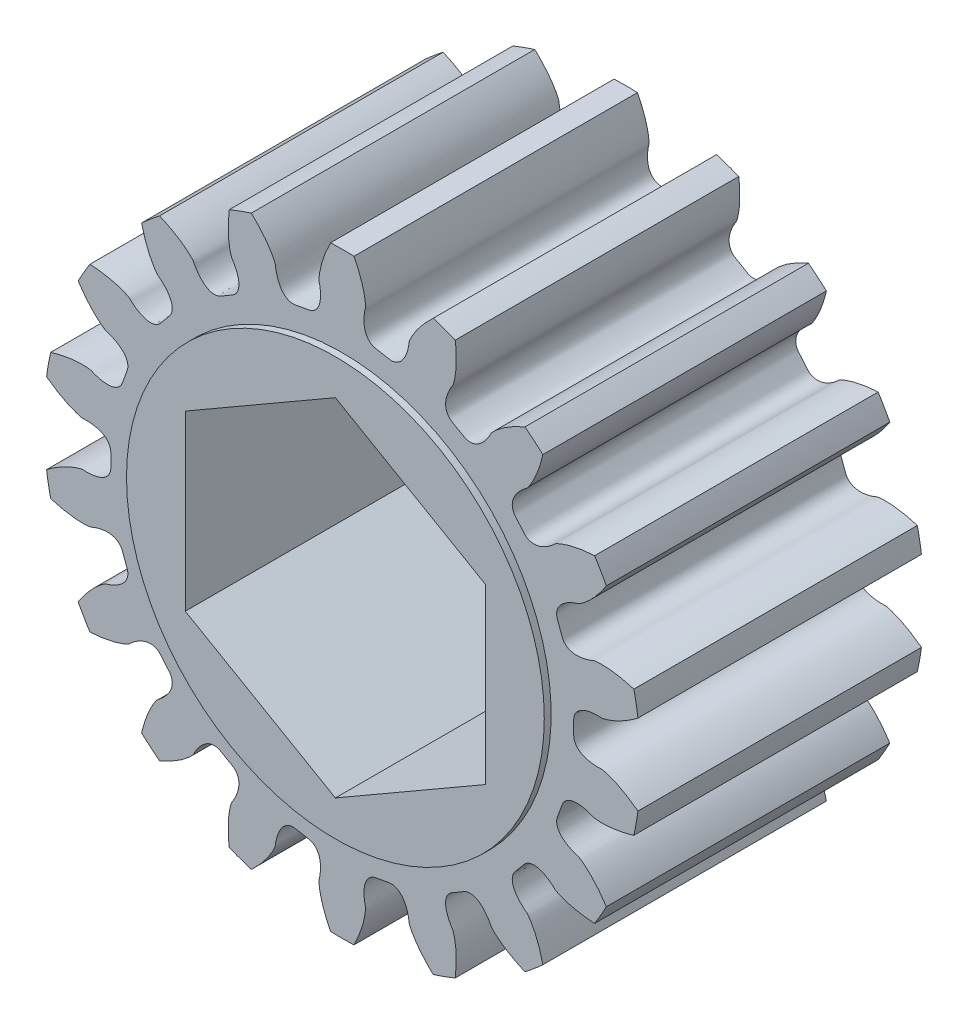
from build123d import *

# Parameters (mm, degrees)
BOSS_EXTRUDE1_DEPTH = 12.065
SKETCH2_R           = 8.89
BOSS_EXTRUDE2_DEPTH = 0.2921
BOSS_EXTRUDE3_START = 0.2921
SKETCH3_R           = 8.89
BOSS_EXTRUDE3_DEPTH = 0.2921
CUT_EXTRUDE1_DEPTH  = 22.900846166


with BuildPart() as part:
    # Sketch1 → Boss-Extrude1 (new body)
    with BuildSketch(Plane.XY.offset(6.0325)):
        with BuildLine():
            ThreePointArc((12.410970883, -2.694030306), (12.507058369, -2.205331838), (12.583910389, -1.713241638))
            add(Edge.make_bspline(
                [(12.583910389, -1.713241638), (12.454495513, -1.615266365), (12.281691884, -1.494600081), (12.063530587, -1.360821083), (11.945634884, -1.293014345), (11.833605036, -1.232708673), (11.727763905, -1.179517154), (11.628417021, -1.133040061), (11.535852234, -1.09286743), (11.450339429, -1.058575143), (11.372129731, -1.029740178), (11.301456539, -1.005894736), (11.238530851, -0.986673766), (11.183554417, -0.971362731), (11.126066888, -0.957744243), (11.037383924, -0.935500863), (10.935383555, -0.952855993), (10.832757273, -0.948980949), (10.755684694, -0.945835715), (10.681454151, -0.939599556), (10.609986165, -0.931080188), (10.541241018, -0.920104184), (10.475144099, -0.906715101), (10.411601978, -0.890856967), (10.350496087, -0.872438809), (10.291684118, -0.851296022), (10.23500406, -0.827170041), (10.180287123, -0.799673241), (10.127386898, -0.768246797), (10.076238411, -0.732113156), (10.026966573, -0.690238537), (9.98006979, -0.641341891), (9.936675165, -0.584030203), (9.898843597, -0.517153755), (9.869552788, -0.440522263), (9.854050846, -0.362318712), (9.847049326, -0.214546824), (9.861767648, -5e-09), (9.847049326, 0.214546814), (9.854050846, 0.362318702), (9.869552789, 0.440522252), (9.898843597, 0.517153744), (9.936675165, 0.584030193), (9.980069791, 0.641341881), (10.026966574, 0.690238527), (10.076238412, 0.732113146), (10.127386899, 0.768246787), (10.180287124, 0.79967323), (10.235004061, 0.82717003), (10.291684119, 0.851296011), (10.350496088, 0.872438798), (10.411601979, 0.890856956), (10.4751441, 0.90671509), (10.541241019, 0.920104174), (10.609986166, 0.931080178), (10.681454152, 0.939599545), (10.755684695, 0.945835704), (10.832757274, 0.948980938), (10.935383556, 0.952855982), (11.037383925, 0.935500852), (11.126066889, 0.957744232), (11.183554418, 0.97136272), (11.238530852, 0.986673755), (11.30145654, 1.005894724), (11.372129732, 1.029740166), (11.45033943, 1.058575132), (11.535852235, 1.092867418), (11.628417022, 1.133040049), (11.727763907, 1.179517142), (11.833605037, 1.23270866), (11.945634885, 1.293014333), (12.063530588, 1.360821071), (12.281691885, 1.494600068), (12.454495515, 1.615266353), (12.58391039, 1.713241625)],
                knots=[0, 0, 0, 0, 0.068568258, 0.088954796, 0.108105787, 0.12602123, 0.142701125, 0.158145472, 0.172354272, 0.185327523, 0.197065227, 0.207567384, 0.216833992, 0.224865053, 0.231660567, 0.241835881, 0.263155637, 0.274398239, 0.285253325, 0.295735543, 0.30586243, 0.315655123, 0.325139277, 0.334346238, 0.343314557, 0.352091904, 0.360737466, 0.369324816, 0.377945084, 0.386709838, 0.395752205, 0.405223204, 0.415278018, 0.42604547, 0.437577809, 0.44979349, 0.459544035, 0.500000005, 0.540455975, 0.550206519, 0.5624222, 0.573954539, 0.584721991, 0.594776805, 0.604247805, 0.613290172, 0.622054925, 0.630675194, 0.639262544, 0.647908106, 0.656685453, 0.665653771, 0.674860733, 0.684344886, 0.69413758, 0.704264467, 0.714746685, 0.725601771, 0.736844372, 0.758164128, 0.768339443, 0.775134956, 0.783166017, 0.792432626, 0.802934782, 0.814672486, 0.827645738, 0.841854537, 0.857298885, 0.87397878, 0.891894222, 0.911045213, 0.931431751, 1.000000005, 1.000000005, 1.000000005, 1.000000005], degree=3))
            ThreePointArc((12.58391039, 1.713241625), (12.507058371, 2.205331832), (12.410970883, 2.694030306))
            add(Edge.make_bspline(
                [(12.410970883, 2.694030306), (12.255851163, 2.741834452), (12.052198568, 2.796121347), (11.801438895, 2.847216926), (11.667461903, 2.870611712), (11.541562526, 2.888964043), (11.423911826, 2.902747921), (11.31466019, 2.912443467), (11.213937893, 2.91853437), (11.121853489, 2.921511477), (11.038498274, 2.921858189), (10.963931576, 2.92009392), (10.898226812, 2.91663387), (10.84132918, 2.912218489), (10.782650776, 2.905353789), (10.691708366, 2.895924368), (10.601795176, 2.8447297), (10.504032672, 2.813270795), (10.430532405, 2.789865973), (10.35864562, 2.770337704), (10.288573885, 2.7538998), (10.220220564, 2.740701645), (10.153530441, 2.730676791), (10.088396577, 2.723845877), (10.024676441, 2.720253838), (9.962180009, 2.720006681), (9.900666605, 2.723291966), (9.839845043, 2.730416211), (9.779386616, 2.741854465), (9.718964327, 2.758315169), (9.658341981, 2.780812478), (9.597549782, 2.810720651), (9.537170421, 2.849734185), (9.478747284, 2.899638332), (9.425013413, 2.961630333), (9.383699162, 3.029815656), (9.326578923, 3.166281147), (9.267030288, 3.372923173), (9.179820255, 3.569497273), (9.13585857, 3.710752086), (9.123678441, 3.789541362), (9.124993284, 3.871569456), (9.137670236, 3.94735192), (9.158846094, 4.016049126), (9.186191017, 4.078036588), (9.218169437, 4.13423782), (9.253874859, 4.185686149), (9.292836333, 4.233310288), (9.334848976, 4.277863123), (9.379859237, 4.319919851), (9.427893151, 4.359902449), (9.479014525, 4.398109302), (9.533300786, 4.434743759), (9.590832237, 4.46993186), (9.651677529, 4.503758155), (9.715921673, 4.536207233), (9.783542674, 4.567455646), (9.854891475, 4.596771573), (9.950003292, 4.63551318), (10.05178809, 4.654090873), (10.127515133, 4.705324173), (10.176877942, 4.737783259), (10.223302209, 4.770973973), (10.275859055, 4.810557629), (10.33411451, 4.85713667), (10.397745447, 4.910981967), (10.466372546, 4.972453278), (10.539615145, 5.041862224), (10.617074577, 5.119515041), (10.698340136, 5.205698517), (10.782988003, 5.300683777), (10.870582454, 5.404723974), (11.029831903, 5.605050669), (11.150943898, 5.777542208), (11.239044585, 5.913871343)],
                knots=[0, 0, 0, 0, 0.068568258, 0.088954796, 0.108105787, 0.12602123, 0.142701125, 0.158145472, 0.172354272, 0.185327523, 0.197065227, 0.207567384, 0.216833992, 0.224865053, 0.231660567, 0.241835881, 0.263155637, 0.274398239, 0.285253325, 0.295735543, 0.30586243, 0.315655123, 0.325139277, 0.334346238, 0.343314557, 0.352091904, 0.360737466, 0.369324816, 0.377945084, 0.386709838, 0.395752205, 0.405223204, 0.415278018, 0.42604547, 0.437577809, 0.44979349, 0.459544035, 0.500000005, 0.540455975, 0.550206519, 0.5624222, 0.573954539, 0.584721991, 0.594776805, 0.604247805, 0.613290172, 0.622054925, 0.630675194, 0.639262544, 0.647908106, 0.656685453, 0.665653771, 0.674860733, 0.684344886, 0.69413758, 0.704264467, 0.714746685, 0.725601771, 0.736844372, 0.758164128, 0.768339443, 0.775134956, 0.783166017, 0.792432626, 0.802934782, 0.814672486, 0.827645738, 0.841854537, 0.857298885, 0.87397878, 0.891894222, 0.911045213, 0.931431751, 1.000000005, 1.000000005, 1.000000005, 1.000000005], degree=3))
            ThreePointArc((11.239044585, 5.913871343), (10.998522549, 6.349999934), (10.741085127, 6.776362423))
            add(Edge.make_bspline(
                [(10.741085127, 6.776362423), (10.57897029, 6.768229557), (10.369032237, 6.749589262), (10.115919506, 6.711838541), (9.982020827, 6.687999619), (9.857437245, 6.662185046), (9.742167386, 6.634898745), (9.636188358, 6.606643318), (9.539457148, 6.57791784), (9.451907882, 6.549220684), (9.373461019, 6.521037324), (9.303994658, 6.493876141), (9.243435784, 6.468152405), (9.191479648, 6.444543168), (9.138687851, 6.418023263), (9.05645499, 6.378058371), (8.989473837, 6.299198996), (8.908366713, 6.23620055), (8.847303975, 6.189068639), (8.786431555, 6.146131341), (8.726207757, 6.106718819), (8.66649068, 6.070938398), (8.607251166, 6.03870875), (8.548381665, 6.010012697), (8.489732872, 5.984843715), (8.431089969, 5.963236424), (8.372162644, 5.945284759), (8.312572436, 5.931177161), (8.251847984, 5.921247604), (8.189439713, 5.916049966), (8.124778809, 5.916456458), (8.057423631, 5.92376879), (7.987342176, 5.939778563), (7.915374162, 5.966691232), (7.843678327, 6.006566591), (7.781534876, 6.05650953), (7.681185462, 6.165208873), (7.554552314, 6.339022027), (7.405369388, 6.49391367), (7.315746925, 6.611613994), (7.277353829, 6.681485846), (7.250534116, 6.759016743), (7.236527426, 6.834564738), (7.232930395, 6.906361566), (7.237425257, 6.97396324), (7.248253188, 7.037712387), (7.264208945, 7.098269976), (7.28453234, 7.156347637), (7.308773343, 7.212582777), (7.336684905, 7.26749759), (7.368147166, 7.321497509), (7.40311803, 7.374884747), (7.441600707, 7.42787687), (7.483627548, 7.480619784), (7.529234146, 7.533216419), (7.578505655, 7.58568137), (7.631361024, 7.638173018), (7.688380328, 7.690123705), (7.764505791, 7.759059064), (7.85379827, 7.811328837), (7.907435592, 7.885372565), (7.942719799, 7.932757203), (7.974992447, 7.979824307), (8.010841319, 8.034996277), (8.04965257, 8.098690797), (8.091029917, 8.171051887), (8.134493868, 8.252287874), (8.17958014, 8.342561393), (8.225809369, 8.442023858), (8.27269753, 8.550804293), (8.319753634, 8.669012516), (8.36648165, 8.796737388), (8.447611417, 9.039449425), (8.502423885, 9.242961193), (8.53858414, 9.401200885)],
                knots=[0, 0, 0, 0, 0.068568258, 0.088954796, 0.108105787, 0.12602123, 0.142701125, 0.158145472, 0.172354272, 0.185327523, 0.197065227, 0.207567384, 0.216833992, 0.224865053, 0.231660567, 0.241835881, 0.263155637, 0.274398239, 0.285253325, 0.295735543, 0.30586243, 0.315655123, 0.325139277, 0.334346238, 0.343314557, 0.352091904, 0.360737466, 0.369324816, 0.377945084, 0.386709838, 0.395752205, 0.405223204, 0.415278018, 0.42604547, 0.437577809, 0.44979349, 0.459544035, 0.500000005, 0.540455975, 0.550206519, 0.5624222, 0.573954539, 0.584721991, 0.594776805, 0.604247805, 0.613290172, 0.622054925, 0.630675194, 0.639262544, 0.647908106, 0.656685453, 0.665653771, 0.674860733, 0.684344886, 0.69413758, 0.704264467, 0.714746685, 0.725601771, 0.736844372, 0.758164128, 0.768339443, 0.775134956, 0.783166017, 0.792432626, 0.802934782, 0.814672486, 0.827645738, 0.841854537, 0.857298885, 0.87397878, 0.891894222, 0.911045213, 0.931431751, 1.000000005, 1.000000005, 1.000000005, 1.000000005], degree=3))
            ThreePointArc((8.53858414, 9.401200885), (8.163402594, 9.728764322), (7.775665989, 10.041365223))
            add(Edge.make_bspline(
                [(7.775665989, 10.041365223), (7.626109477, 9.978276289), (7.435207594, 9.888957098), (7.210270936, 9.766913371), (7.092600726, 9.698716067), (6.984359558, 9.631848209), (6.885373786, 9.56678286), (6.795450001, 9.503984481), (6.714377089, 9.443907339), (6.641922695, 9.386997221), (6.577846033, 9.333683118), (6.521858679, 9.28440106), (6.473749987, 9.2395163), (6.433002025, 9.199560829), (6.392464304, 9.156584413), (6.32885949, 9.090904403), (6.292889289, 8.993891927), (6.238220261, 8.906952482), (6.196960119, 8.841778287), (6.154444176, 8.780610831), (6.111332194, 8.722977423), (6.067454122, 8.668930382), (6.022810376, 8.618383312), (5.977305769, 8.571283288), (5.93080223, 8.527573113), (5.883086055, 8.487211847), (5.833852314, 8.450188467), (5.782680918, 8.41655061), (5.729014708, 8.386450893), (5.672147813, 8.360221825), (5.61124741, 8.338488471), (5.545453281, 8.322322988), (5.47412259, 8.313397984), (5.397290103, 8.31407311), (5.31627988, 8.327022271), (5.240802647, 8.352698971), (5.109327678, 8.42052142), (4.930883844, 8.54054127), (4.737721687, 8.635068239), (4.613248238, 8.715017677), (4.553272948, 8.767544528), (4.501553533, 8.831226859), (4.462552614, 8.897428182), (4.434616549, 8.963664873), (4.415719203, 9.028727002), (4.404090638, 9.092334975), (4.39837223, 9.154697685), (4.397606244, 9.216223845), (4.401151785, 9.277358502), (4.408598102, 9.338507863), (4.419693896, 9.400011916), (4.434296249, 9.462140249), (4.452333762, 9.525098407), (4.473786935, 9.58903456), (4.49865401, 9.654057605), (4.527010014, 9.720210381), (4.558724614, 9.787613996), (4.594537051, 9.855933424), (4.642494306, 9.946747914), (4.708524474, 10.02640526), (4.733602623, 10.114328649), (4.750552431, 10.170923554), (4.764780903, 10.22619006), (4.779597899, 10.290295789), (4.794283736, 10.363423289), (4.808416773, 10.445572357), (4.821475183, 10.536774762), (4.832967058, 10.637024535), (4.842390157, 10.746300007), (4.849245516, 10.864556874), (4.853034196, 10.991730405), (4.853259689, 11.127734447), (4.846484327, 11.383557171), (4.828386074, 11.593542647), (4.808244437, 11.754606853)],
                knots=[0, 0, 0, 0, 0.068568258, 0.088954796, 0.108105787, 0.12602123, 0.142701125, 0.158145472, 0.172354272, 0.185327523, 0.197065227, 0.207567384, 0.216833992, 0.224865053, 0.231660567, 0.241835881, 0.263155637, 0.274398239, 0.285253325, 0.295735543, 0.30586243, 0.315655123, 0.325139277, 0.334346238, 0.343314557, 0.352091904, 0.360737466, 0.369324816, 0.377945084, 0.386709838, 0.395752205, 0.405223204, 0.415278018, 0.42604547, 0.437577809, 0.44979349, 0.459544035, 0.500000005, 0.540455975, 0.550206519, 0.5624222, 0.573954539, 0.584721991, 0.594776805, 0.604247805, 0.613290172, 0.622054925, 0.630675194, 0.639262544, 0.647908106, 0.656685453, 0.665653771, 0.674860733, 0.684344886, 0.69413758, 0.704264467, 0.714746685, 0.725601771, 0.736844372, 0.758164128, 0.768339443, 0.775134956, 0.783166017, 0.792432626, 0.802934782, 0.814672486, 0.827645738, 0.841854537, 0.857298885, 0.87397878, 0.891894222, 0.911045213, 0.931431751, 1.000000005, 1.000000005, 1.000000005, 1.000000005], degree=3))
            ThreePointArc((4.808244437, 11.754606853), (4.343655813, 11.934096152), (3.872386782, 12.095231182))
            add(Edge.make_bspline(
                [(3.872386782, 12.095231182), (3.753427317, 11.984795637), (3.604587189, 11.835570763), (3.434957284, 11.643954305), (3.347708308, 11.53962422), (3.268865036, 11.439768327), (3.198102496, 11.344771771), (3.13508009, 11.255004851), (3.079444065, 11.170822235), (3.030823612, 11.092563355), (2.988845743, 11.020548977), (2.953090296, 10.955090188), (2.923234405, 10.896458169), (2.898609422, 10.844975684), (2.875215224, 10.790726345), (2.837910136, 10.707253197), (2.837289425, 10.603788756), (2.815652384, 10.503394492), (2.799171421, 10.428038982), (2.780140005, 10.356019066), (2.75933978, 10.287116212), (2.736593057, 10.221321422), (2.711929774, 10.158553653), (2.685278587, 10.098730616), (2.656529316, 10.04175134), (2.625495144, 9.987504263), (2.591893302, 9.935874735), (2.555312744, 9.886763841), (2.515177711, 9.840124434), (2.47071118, 9.796027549), (2.420916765, 9.754775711), (2.364619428, 9.717082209), (2.300643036, 9.684298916), (2.228213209, 9.658655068), (2.147659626, 9.643116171), (2.067952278, 9.641429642), (1.921209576, 9.66019481), (1.712478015, 9.711945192), (1.498634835, 9.734706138), (1.354323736, 9.767261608), (1.280000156, 9.796107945), (1.209619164, 9.83826068), (1.150328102, 9.887130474), (1.101422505, 9.939817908), (1.06141225, 9.994493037), (1.028729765, 10.050287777), (1.002026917, 10.106933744), (0.980263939, 10.16448744), (0.962686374, 10.223147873), (0.948769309, 10.283156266), (0.93816032, 10.344746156), (0.930632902, 10.408121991), (0.926049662, 10.4734525), (0.924341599, 10.540870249), (0.925469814, 10.610476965), (0.92949016, 10.682338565), (0.936238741, 10.756524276), (0.946524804, 10.832972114), (0.960529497, 10.934712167), (0.995333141, 11.032149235), (0.988827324, 11.123347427), (0.985398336, 11.182326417), (0.979866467, 11.239126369), (0.971864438, 11.30443376), (0.960653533, 11.378173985), (0.945837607, 11.460202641), (0.92691544, 11.550371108), (0.903426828, 11.648505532), (0.874907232, 11.754413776), (0.840902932, 11.867883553), (0.800967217, 11.988683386), (0.754662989, 12.116562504), (0.660799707, 12.35463992), (0.571973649, 12.545771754), (0.497959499, 12.690233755)],
                knots=[0, 0, 0, 0, 0.068568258, 0.088954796, 0.108105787, 0.12602123, 0.142701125, 0.158145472, 0.172354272, 0.185327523, 0.197065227, 0.207567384, 0.216833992, 0.224865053, 0.231660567, 0.241835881, 0.263155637, 0.274398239, 0.285253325, 0.295735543, 0.30586243, 0.315655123, 0.325139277, 0.334346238, 0.343314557, 0.352091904, 0.360737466, 0.369324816, 0.377945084, 0.386709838, 0.395752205, 0.405223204, 0.415278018, 0.42604547, 0.437577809, 0.44979349, 0.459544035, 0.500000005, 0.540455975, 0.550206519, 0.5624222, 0.573954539, 0.584721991, 0.594776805, 0.604247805, 0.613290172, 0.622054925, 0.630675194, 0.639262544, 0.647908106, 0.656685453, 0.665653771, 0.674860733, 0.684344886, 0.69413758, 0.704264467, 0.714746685, 0.725601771, 0.736844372, 0.758164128, 0.768339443, 0.775134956, 0.783166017, 0.792432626, 0.802934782, 0.814672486, 0.827645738, 0.841854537, 0.857298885, 0.87397878, 0.891894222, 0.911045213, 0.931431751, 1.000000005, 1.000000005, 1.000000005, 1.000000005], degree=3))
            ThreePointArc((0.497959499, 12.690233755), (4.2e-08, 12.699999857), (-0.497959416, 12.690233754))
            add(Edge.make_bspline(
                [(-0.497959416, 12.690233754), (-0.571973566, 12.545771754), (-0.660799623, 12.354639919), (-0.754662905, 12.116562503), (-0.800967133, 11.988683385), (-0.840902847, 11.867883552), (-0.874907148, 11.754413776), (-0.903426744, 11.648505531), (-0.926915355, 11.550371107), (-0.945837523, 11.46020264), (-0.960653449, 11.378173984), (-0.971864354, 11.304433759), (-0.979866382, 11.239126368), (-0.985398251, 11.182326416), (-0.988827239, 11.123347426), (-0.995333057, 11.032149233), (-0.960529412, 10.934712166), (-0.946524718, 10.832972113), (-0.936238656, 10.756524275), (-0.929490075, 10.682338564), (-0.925469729, 10.610476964), (-0.924341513, 10.540870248), (-0.926049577, 10.473452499), (-0.930632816, 10.40812199), (-0.938160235, 10.344746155), (-0.948769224, 10.283156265), (-0.962686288, 10.223147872), (-0.980263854, 10.164487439), (-1.002026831, 10.106933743), (-1.028729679, 10.050287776), (-1.061412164, 9.994493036), (-1.101422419, 9.939817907), (-1.150328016, 9.887130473), (-1.209619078, 9.838260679), (-1.28000007, 9.796107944), (-1.354323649, 9.767261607), (-1.498634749, 9.734706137), (-1.712477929, 9.71194519), (-1.92120949, 9.660194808), (-2.067952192, 9.64142964), (-2.147659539, 9.643116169), (-2.228213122, 9.658655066), (-2.30064295, 9.684298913), (-2.364619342, 9.717082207), (-2.420916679, 9.754775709), (-2.470711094, 9.796027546), (-2.515177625, 9.840124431), (-2.555312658, 9.886763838), (-2.591893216, 9.935874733), (-2.625495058, 9.987504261), (-2.65652923, 10.041751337), (-2.685278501, 10.098730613), (-2.711929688, 10.158553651), (-2.736592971, 10.221321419), (-2.759339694, 10.287116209), (-2.78013992, 10.356019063), (-2.799171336, 10.42803898), (-2.815652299, 10.503394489), (-2.837289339, 10.603788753), (-2.837910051, 10.707253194), (-2.875215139, 10.790726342), (-2.898609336, 10.844975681), (-2.92323432, 10.896458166), (-2.953090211, 10.955090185), (-2.988845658, 11.020548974), (-3.030823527, 11.092563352), (-3.07944398, 11.170822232), (-3.135080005, 11.255004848), (-3.198102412, 11.344771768), (-3.268864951, 11.439768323), (-3.347708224, 11.539624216), (-3.434957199, 11.643954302), (-3.604587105, 11.835570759), (-3.753427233, 11.984795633), (-3.872386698, 12.095231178)],
                knots=[0, 0, 0, 0, 0.068568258, 0.088954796, 0.108105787, 0.12602123, 0.142701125, 0.158145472, 0.172354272, 0.185327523, 0.197065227, 0.207567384, 0.216833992, 0.224865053, 0.231660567, 0.241835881, 0.263155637, 0.274398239, 0.285253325, 0.295735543, 0.30586243, 0.315655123, 0.325139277, 0.334346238, 0.343314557, 0.352091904, 0.360737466, 0.369324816, 0.377945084, 0.386709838, 0.395752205, 0.405223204, 0.415278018, 0.42604547, 0.437577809, 0.44979349, 0.459544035, 0.500000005, 0.540455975, 0.550206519, 0.5624222, 0.573954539, 0.584721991, 0.594776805, 0.604247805, 0.613290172, 0.622054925, 0.630675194, 0.639262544, 0.647908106, 0.656685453, 0.665653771, 0.674860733, 0.684344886, 0.69413758, 0.704264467, 0.714746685, 0.725601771, 0.736844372, 0.758164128, 0.768339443, 0.775134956, 0.783166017, 0.792432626, 0.802934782, 0.814672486, 0.827645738, 0.841854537, 0.857298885, 0.87397878, 0.891894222, 0.911045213, 0.931431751, 1.000000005, 1.000000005, 1.000000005, 1.000000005], degree=3))
            ThreePointArc((-3.872386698, 12.095231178), (-4.343655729, 11.934096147), (-4.808244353, 11.754606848))
            add(Edge.make_bspline(
                [(-4.808244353, 11.754606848), (-4.82838599, 11.593542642), (-4.846484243, 11.383557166), (-4.853259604, 11.127734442), (-4.853034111, 10.9917304), (-4.849245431, 10.864556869), (-4.842390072, 10.746300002), (-4.832966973, 10.63702453), (-4.821475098, 10.536774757), (-4.808416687, 10.445572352), (-4.794283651, 10.363423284), (-4.779597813, 10.290295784), (-4.764780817, 10.226190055), (-4.750552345, 10.170923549), (-4.733602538, 10.114328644), (-4.708524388, 10.026405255), (-4.64249422, 9.946747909), (-4.594536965, 9.855933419), (-4.558724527, 9.787613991), (-4.527009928, 9.720210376), (-4.498653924, 9.6540576), (-4.473786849, 9.589034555), (-4.452333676, 9.525098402), (-4.434296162, 9.462140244), (-4.419693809, 9.400011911), (-4.408598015, 9.338507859), (-4.401151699, 9.277358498), (-4.397606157, 9.21622384), (-4.398372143, 9.15469768), (-4.404090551, 9.092334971), (-4.415719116, 9.028726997), (-4.434616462, 8.963664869), (-4.462552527, 8.897428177), (-4.501553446, 8.831226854), (-4.553272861, 8.767544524), (-4.613248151, 8.715017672), (-4.7377216, 8.635068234), (-4.930883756, 8.540541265), (-5.109327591, 8.420521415), (-5.240802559, 8.352698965), (-5.316279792, 8.327022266), (-5.397290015, 8.314073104), (-5.474122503, 8.313397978), (-5.545453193, 8.322322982), (-5.611247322, 8.338488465), (-5.672147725, 8.360221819), (-5.72901462, 8.386450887), (-5.78268083, 8.416550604), (-5.833852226, 8.450188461), (-5.883085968, 8.487211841), (-5.930802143, 8.527573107), (-5.977305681, 8.571283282), (-6.022810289, 8.618383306), (-6.067454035, 8.668930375), (-6.111332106, 8.722977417), (-6.154444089, 8.780610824), (-6.196960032, 8.84177828), (-6.238220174, 8.906952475), (-6.292889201, 8.993891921), (-6.328859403, 9.090904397), (-6.392464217, 9.156584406), (-6.433001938, 9.199560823), (-6.4737499, 9.239516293), (-6.521858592, 9.284401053), (-6.577845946, 9.333683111), (-6.641922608, 9.386997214), (-6.714377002, 9.443907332), (-6.795449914, 9.503984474), (-6.8853737, 9.566782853), (-6.984359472, 9.631848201), (-7.09260064, 9.69871606), (-7.210270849, 9.766913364), (-7.435207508, 9.88895709), (-7.626109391, 9.978276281), (-7.775665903, 10.041365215)],
                knots=[0, 0, 0, 0, 0.068568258, 0.088954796, 0.108105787, 0.12602123, 0.142701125, 0.158145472, 0.172354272, 0.185327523, 0.197065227, 0.207567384, 0.216833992, 0.224865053, 0.231660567, 0.241835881, 0.263155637, 0.274398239, 0.285253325, 0.295735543, 0.30586243, 0.315655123, 0.325139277, 0.334346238, 0.343314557, 0.352091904, 0.360737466, 0.369324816, 0.377945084, 0.386709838, 0.395752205, 0.405223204, 0.415278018, 0.42604547, 0.437577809, 0.44979349, 0.459544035, 0.500000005, 0.540455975, 0.550206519, 0.5624222, 0.573954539, 0.584721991, 0.594776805, 0.604247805, 0.613290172, 0.622054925, 0.630675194, 0.639262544, 0.647908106, 0.656685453, 0.665653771, 0.674860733, 0.684344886, 0.69413758, 0.704264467, 0.714746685, 0.725601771, 0.736844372, 0.758164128, 0.768339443, 0.775134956, 0.783166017, 0.792432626, 0.802934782, 0.814672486, 0.827645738, 0.841854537, 0.857298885, 0.87397878, 0.891894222, 0.911045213, 0.931431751, 1.000000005, 1.000000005, 1.000000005, 1.000000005], degree=3))
            ThreePointArc((-7.775665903, 10.041365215), (-8.163402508, 9.728764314), (-8.538584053, 9.401200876))
            add(Edge.make_bspline(
                [(-8.538584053, 9.401200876), (-8.502423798, 9.242961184), (-8.44761133, 9.039449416), (-8.366481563, 8.79673738), (-8.319753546, 8.669012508), (-8.272697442, 8.550804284), (-8.225809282, 8.44202385), (-8.179580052, 8.342561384), (-8.13449378, 8.252287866), (-8.091029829, 8.171051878), (-8.049652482, 8.098690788), (-8.010841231, 8.034996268), (-7.974992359, 7.979824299), (-7.942719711, 7.932757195), (-7.907435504, 7.885372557), (-7.853798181, 7.811328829), (-7.764505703, 7.759059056), (-7.68838024, 7.690123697), (-7.631360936, 7.63817301), (-7.578505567, 7.585681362), (-7.529234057, 7.533216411), (-7.483627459, 7.480619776), (-7.441600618, 7.427876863), (-7.403117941, 7.374884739), (-7.368147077, 7.321497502), (-7.336684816, 7.267497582), (-7.308773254, 7.21258277), (-7.284532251, 7.15634763), (-7.264208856, 7.098269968), (-7.248253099, 7.03771238), (-7.237425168, 6.973963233), (-7.232930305, 6.906361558), (-7.236527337, 6.834564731), (-7.250534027, 6.759016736), (-7.277353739, 6.681485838), (-7.315746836, 6.611613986), (-7.405369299, 6.493913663), (-7.554552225, 6.339022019), (-7.681185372, 6.165208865), (-7.781534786, 6.056509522), (-7.843678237, 6.006566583), (-7.915374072, 5.966691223), (-7.987342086, 5.939778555), (-8.057423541, 5.923768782), (-8.124778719, 5.916456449), (-8.189439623, 5.916049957), (-8.251847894, 5.921247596), (-8.312572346, 5.931177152), (-8.372162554, 5.94528475), (-8.431089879, 5.963236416), (-8.489732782, 5.984843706), (-8.548381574, 6.010012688), (-8.607251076, 6.038708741), (-8.66649059, 6.070938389), (-8.726207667, 6.10671881), (-8.786431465, 6.146131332), (-8.847303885, 6.18906863), (-8.908366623, 6.236200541), (-8.989473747, 6.299198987), (-9.056454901, 6.378058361), (-9.138687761, 6.418023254), (-9.191479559, 6.444543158), (-9.243435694, 6.468152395), (-9.303994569, 6.493876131), (-9.373460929, 6.521037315), (-9.451907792, 6.549220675), (-9.539457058, 6.57791783), (-9.636188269, 6.606643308), (-9.742167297, 6.634898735), (-9.857437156, 6.662185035), (-9.982020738, 6.687999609), (-10.115919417, 6.71183853), (-10.369032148, 6.749589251), (-10.578970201, 6.768229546), (-10.741085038, 6.776362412)],
                knots=[0, 0, 0, 0, 0.068568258, 0.088954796, 0.108105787, 0.12602123, 0.142701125, 0.158145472, 0.172354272, 0.185327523, 0.197065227, 0.207567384, 0.216833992, 0.224865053, 0.231660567, 0.241835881, 0.263155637, 0.274398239, 0.285253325, 0.295735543, 0.30586243, 0.315655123, 0.325139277, 0.334346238, 0.343314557, 0.352091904, 0.360737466, 0.369324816, 0.377945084, 0.386709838, 0.395752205, 0.405223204, 0.415278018, 0.42604547, 0.437577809, 0.44979349, 0.459544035, 0.500000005, 0.540455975, 0.550206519, 0.5624222, 0.573954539, 0.584721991, 0.594776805, 0.604247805, 0.613290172, 0.622054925, 0.630675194, 0.639262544, 0.647908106, 0.656685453, 0.665653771, 0.674860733, 0.684344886, 0.69413758, 0.704264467, 0.714746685, 0.725601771, 0.736844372, 0.758164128, 0.768339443, 0.775134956, 0.783166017, 0.792432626, 0.802934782, 0.814672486, 0.827645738, 0.841854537, 0.857298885, 0.87397878, 0.891894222, 0.911045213, 0.931431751, 1.000000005, 1.000000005, 1.000000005, 1.000000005], degree=3))
            ThreePointArc((-10.741085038, 6.776362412), (-10.998522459, 6.349999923), (-11.239044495, 5.913871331))
            add(Edge.make_bspline(
                [(-11.239044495, 5.913871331), (-11.150943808, 5.777542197), (-11.029831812, 5.605050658), (-10.870582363, 5.404723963), (-10.782987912, 5.300683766), (-10.698340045, 5.205698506), (-10.617074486, 5.11951503), (-10.539615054, 5.041862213), (-10.466372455, 4.972453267), (-10.397745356, 4.910981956), (-10.334114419, 4.85713666), (-10.275858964, 4.810557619), (-10.223302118, 4.770973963), (-10.176877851, 4.737783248), (-10.127515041, 4.705324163), (-10.051787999, 4.654090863), (-9.950003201, 4.635513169), (-9.854891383, 4.596771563), (-9.783542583, 4.567455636), (-9.715921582, 4.536207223), (-9.651677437, 4.503758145), (-9.590832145, 4.46993185), (-9.533300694, 4.434743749), (-9.479014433, 4.398109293), (-9.427893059, 4.35990244), (-9.379859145, 4.319919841), (-9.334848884, 4.277863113), (-9.292836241, 4.233310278), (-9.253874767, 4.185686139), (-9.218169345, 4.13423781), (-9.186190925, 4.078036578), (-9.158846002, 4.016049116), (-9.137670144, 3.94735191), (-9.124993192, 3.871569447), (-9.123678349, 3.789541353), (-9.135858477, 3.710752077), (-9.179820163, 3.569497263), (-9.267030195, 3.372923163), (-9.32657883, 3.166281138), (-9.383699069, 3.029815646), (-9.42501332, 2.961630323), (-9.47874719, 2.899638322), (-9.537170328, 2.849734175), (-9.597549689, 2.810720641), (-9.658341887, 2.780812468), (-9.718964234, 2.758315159), (-9.779386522, 2.741854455), (-9.83984495, 2.730416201), (-9.900666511, 2.723291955), (-9.962179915, 2.720006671), (-10.024676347, 2.720253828), (-10.088396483, 2.723845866), (-10.153530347, 2.73067678), (-10.220220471, 2.740701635), (-10.288573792, 2.75389979), (-10.358645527, 2.770337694), (-10.430532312, 2.789865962), (-10.504032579, 2.813270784), (-10.601795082, 2.844729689), (-10.691708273, 2.895924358), (-10.782650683, 2.905353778), (-10.841329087, 2.912218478), (-10.898226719, 2.916633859), (-10.963931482, 2.920093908), (-11.03849818, 2.921858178), (-11.121853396, 2.921511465), (-11.2139378, 2.918534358), (-11.314660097, 2.912443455), (-11.423911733, 2.90274791), (-11.541562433, 2.888964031), (-11.667461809, 2.8706117), (-11.801438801, 2.847216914), (-12.052198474, 2.796121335), (-12.25585107, 2.74183444), (-12.41097079, 2.694030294)],
                knots=[0, 0, 0, 0, 0.068568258, 0.088954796, 0.108105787, 0.12602123, 0.142701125, 0.158145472, 0.172354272, 0.185327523, 0.197065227, 0.207567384, 0.216833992, 0.224865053, 0.231660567, 0.241835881, 0.263155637, 0.274398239, 0.285253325, 0.295735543, 0.30586243, 0.315655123, 0.325139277, 0.334346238, 0.343314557, 0.352091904, 0.360737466, 0.369324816, 0.377945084, 0.386709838, 0.395752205, 0.405223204, 0.415278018, 0.42604547, 0.437577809, 0.44979349, 0.459544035, 0.500000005, 0.540455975, 0.550206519, 0.5624222, 0.573954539, 0.584721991, 0.594776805, 0.604247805, 0.613290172, 0.622054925, 0.630675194, 0.639262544, 0.647908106, 0.656685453, 0.665653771, 0.674860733, 0.684344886, 0.69413758, 0.704264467, 0.714746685, 0.725601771, 0.736844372, 0.758164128, 0.768339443, 0.775134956, 0.783166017, 0.792432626, 0.802934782, 0.814672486, 0.827645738, 0.841854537, 0.857298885, 0.87397878, 0.891894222, 0.911045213, 0.931431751, 1.000000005, 1.000000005, 1.000000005, 1.000000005], degree=3))
            ThreePointArc((-12.41097079, 2.694030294), (-12.507058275, 2.205331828), (-12.583910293, 1.713241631))
            add(Edge.make_bspline(
                [(-12.583910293, 1.713241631), (-12.454495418, 1.615266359), (-12.281691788, 1.494600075), (-12.063530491, 1.360821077), (-11.945634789, 1.293014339), (-11.83360494, 1.232708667), (-11.72776381, 1.179517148), (-11.628416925, 1.133040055), (-11.535852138, 1.092867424), (-11.450339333, 1.058575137), (-11.372129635, 1.029740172), (-11.301456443, 1.00589473), (-11.238530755, 0.986673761), (-11.183554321, 0.971362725), (-11.126066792, 0.957744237), (-11.037383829, 0.935500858), (-10.93538346, 0.952855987), (-10.832757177, 0.948980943), (-10.755684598, 0.94583571), (-10.681454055, 0.939599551), (-10.609986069, 0.931080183), (-10.541240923, 0.920104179), (-10.475144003, 0.906715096), (-10.411601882, 0.890856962), (-10.350495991, 0.872438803), (-10.291684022, 0.851296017), (-10.235003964, 0.827170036), (-10.180287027, 0.799673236), (-10.127386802, 0.768246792), (-10.076238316, 0.732113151), (-10.026966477, 0.690238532), (-9.980069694, 0.641341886), (-9.936675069, 0.584030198), (-9.898843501, 0.51715375), (-9.869552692, 0.440522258), (-9.85405075, 0.362318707), (-9.84704923, 0.214546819), (-9.861767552, 0), (-9.84704923, -0.214546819), (-9.85405075, -0.362318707), (-9.869552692, -0.440522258), (-9.898843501, -0.51715375), (-9.936675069, -0.584030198), (-9.980069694, -0.641341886), (-10.026966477, -0.690238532), (-10.076238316, -0.732113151), (-10.127386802, -0.768246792), (-10.180287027, -0.799673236), (-10.235003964, -0.827170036), (-10.291684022, -0.851296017), (-10.350495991, -0.872438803), (-10.411601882, -0.890856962), (-10.475144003, -0.906715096), (-10.541240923, -0.920104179), (-10.609986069, -0.931080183), (-10.681454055, -0.939599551), (-10.755684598, -0.94583571), (-10.832757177, -0.948980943), (-10.93538346, -0.952855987), (-11.037383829, -0.935500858), (-11.126066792, -0.957744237), (-11.183554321, -0.971362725), (-11.238530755, -0.986673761), (-11.301456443, -1.00589473), (-11.372129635, -1.029740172), (-11.450339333, -1.058575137), (-11.535852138, -1.092867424), (-11.628416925, -1.133040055), (-11.72776381, -1.179517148), (-11.83360494, -1.232708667), (-11.945634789, -1.293014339), (-12.063530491, -1.360821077), (-12.281691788, -1.494600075), (-12.454495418, -1.615266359), (-12.583910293, -1.713241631)],
                knots=[0, 0, 0, 0, 0.068568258, 0.088954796, 0.108105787, 0.12602123, 0.142701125, 0.158145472, 0.172354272, 0.185327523, 0.197065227, 0.207567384, 0.216833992, 0.224865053, 0.231660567, 0.241835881, 0.263155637, 0.274398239, 0.285253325, 0.295735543, 0.30586243, 0.315655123, 0.325139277, 0.334346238, 0.343314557, 0.352091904, 0.360737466, 0.369324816, 0.377945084, 0.386709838, 0.395752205, 0.405223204, 0.415278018, 0.42604547, 0.437577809, 0.44979349, 0.459544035, 0.500000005, 0.540455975, 0.550206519, 0.5624222, 0.573954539, 0.584721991, 0.594776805, 0.604247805, 0.613290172, 0.622054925, 0.630675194, 0.639262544, 0.647908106, 0.656685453, 0.665653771, 0.674860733, 0.684344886, 0.69413758, 0.704264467, 0.714746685, 0.725601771, 0.736844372, 0.758164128, 0.768339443, 0.775134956, 0.783166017, 0.792432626, 0.802934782, 0.814672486, 0.827645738, 0.841854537, 0.857298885, 0.87397878, 0.891894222, 0.911045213, 0.931431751, 1.000000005, 1.000000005, 1.000000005, 1.000000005], degree=3))
            ThreePointArc((-12.583910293, -1.713241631), (-12.507058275, -2.205331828), (-12.41097079, -2.694030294))
            add(Edge.make_bspline(
                [(-12.41097079, -2.694030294), (-12.25585107, -2.74183444), (-12.052198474, -2.796121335), (-11.801438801, -2.847216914), (-11.667461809, -2.8706117), (-11.541562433, -2.888964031), (-11.423911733, -2.90274791), (-11.314660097, -2.912443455), (-11.2139378, -2.918534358), (-11.121853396, -2.921511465), (-11.03849818, -2.921858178), (-10.963931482, -2.920093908), (-10.898226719, -2.916633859), (-10.841329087, -2.912218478), (-10.782650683, -2.905353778), (-10.691708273, -2.895924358), (-10.601795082, -2.844729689), (-10.504032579, -2.813270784), (-10.430532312, -2.789865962), (-10.358645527, -2.770337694), (-10.288573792, -2.75389979), (-10.220220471, -2.740701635), (-10.153530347, -2.73067678), (-10.088396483, -2.723845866), (-10.024676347, -2.720253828), (-9.962179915, -2.720006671), (-9.900666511, -2.723291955), (-9.83984495, -2.730416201), (-9.779386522, -2.741854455), (-9.718964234, -2.758315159), (-9.658341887, -2.780812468), (-9.597549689, -2.810720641), (-9.537170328, -2.849734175), (-9.47874719, -2.899638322), (-9.42501332, -2.961630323), (-9.383699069, -3.029815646), (-9.32657883, -3.166281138), (-9.267030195, -3.372923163), (-9.179820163, -3.569497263), (-9.135858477, -3.710752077), (-9.123678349, -3.789541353), (-9.124993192, -3.871569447), (-9.137670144, -3.94735191), (-9.158846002, -4.016049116), (-9.186190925, -4.078036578), (-9.218169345, -4.13423781), (-9.253874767, -4.185686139), (-9.292836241, -4.233310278), (-9.334848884, -4.277863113), (-9.379859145, -4.319919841), (-9.427893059, -4.35990244), (-9.479014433, -4.398109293), (-9.533300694, -4.434743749), (-9.590832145, -4.46993185), (-9.651677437, -4.503758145), (-9.715921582, -4.536207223), (-9.783542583, -4.567455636), (-9.854891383, -4.596771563), (-9.950003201, -4.635513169), (-10.051787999, -4.654090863), (-10.127515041, -4.705324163), (-10.176877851, -4.737783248), (-10.223302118, -4.770973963), (-10.275858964, -4.810557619), (-10.334114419, -4.85713666), (-10.397745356, -4.910981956), (-10.466372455, -4.972453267), (-10.539615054, -5.041862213), (-10.617074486, -5.11951503), (-10.698340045, -5.205698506), (-10.782987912, -5.300683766), (-10.870582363, -5.404723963), (-11.029831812, -5.605050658), (-11.150943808, -5.777542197), (-11.239044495, -5.913871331)],
                knots=[0, 0, 0, 0, 0.068568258, 0.088954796, 0.108105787, 0.12602123, 0.142701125, 0.158145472, 0.172354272, 0.185327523, 0.197065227, 0.207567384, 0.216833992, 0.224865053, 0.231660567, 0.241835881, 0.263155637, 0.274398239, 0.285253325, 0.295735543, 0.30586243, 0.315655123, 0.325139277, 0.334346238, 0.343314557, 0.352091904, 0.360737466, 0.369324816, 0.377945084, 0.386709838, 0.395752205, 0.405223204, 0.415278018, 0.42604547, 0.437577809, 0.44979349, 0.459544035, 0.500000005, 0.540455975, 0.550206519, 0.5624222, 0.573954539, 0.584721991, 0.594776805, 0.604247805, 0.613290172, 0.622054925, 0.630675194, 0.639262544, 0.647908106, 0.656685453, 0.665653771, 0.674860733, 0.684344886, 0.69413758, 0.704264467, 0.714746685, 0.725601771, 0.736844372, 0.758164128, 0.768339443, 0.775134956, 0.783166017, 0.792432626, 0.802934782, 0.814672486, 0.827645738, 0.841854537, 0.857298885, 0.87397878, 0.891894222, 0.911045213, 0.931431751, 1.000000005, 1.000000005, 1.000000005, 1.000000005], degree=3))
            ThreePointArc((-11.239044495, -5.913871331), (-10.998522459, -6.349999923), (-10.741085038, -6.776362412))
            add(Edge.make_bspline(
                [(-10.741085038, -6.776362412), (-10.578970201, -6.768229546), (-10.369032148, -6.749589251), (-10.115919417, -6.71183853), (-9.982020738, -6.687999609), (-9.857437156, -6.662185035), (-9.742167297, -6.634898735), (-9.636188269, -6.606643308), (-9.539457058, -6.57791783), (-9.451907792, -6.549220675), (-9.373460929, -6.521037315), (-9.303994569, -6.493876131), (-9.243435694, -6.468152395), (-9.191479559, -6.444543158), (-9.138687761, -6.418023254), (-9.056454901, -6.378058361), (-8.989473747, -6.299198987), (-8.908366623, -6.236200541), (-8.847303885, -6.18906863), (-8.786431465, -6.146131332), (-8.726207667, -6.10671881), (-8.66649059, -6.070938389), (-8.607251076, -6.038708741), (-8.548381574, -6.010012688), (-8.489732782, -5.984843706), (-8.431089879, -5.963236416), (-8.372162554, -5.94528475), (-8.312572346, -5.931177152), (-8.251847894, -5.921247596), (-8.189439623, -5.916049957), (-8.124778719, -5.916456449), (-8.057423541, -5.923768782), (-7.987342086, -5.939778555), (-7.915374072, -5.966691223), (-7.843678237, -6.006566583), (-7.781534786, -6.056509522), (-7.681185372, -6.165208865), (-7.554552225, -6.339022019), (-7.405369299, -6.493913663), (-7.315746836, -6.611613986), (-7.277353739, -6.681485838), (-7.250534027, -6.759016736), (-7.236527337, -6.834564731), (-7.232930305, -6.906361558), (-7.237425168, -6.973963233), (-7.248253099, -7.03771238), (-7.264208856, -7.098269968), (-7.284532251, -7.15634763), (-7.308773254, -7.21258277), (-7.336684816, -7.267497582), (-7.368147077, -7.321497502), (-7.403117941, -7.374884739), (-7.441600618, -7.427876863), (-7.483627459, -7.480619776), (-7.529234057, -7.533216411), (-7.578505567, -7.585681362), (-7.631360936, -7.63817301), (-7.68838024, -7.690123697), (-7.764505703, -7.759059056), (-7.853798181, -7.811328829), (-7.907435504, -7.885372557), (-7.942719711, -7.932757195), (-7.974992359, -7.979824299), (-8.010841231, -8.034996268), (-8.049652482, -8.098690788), (-8.091029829, -8.171051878), (-8.13449378, -8.252287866), (-8.179580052, -8.342561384), (-8.225809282, -8.44202385), (-8.272697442, -8.550804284), (-8.319753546, -8.669012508), (-8.366481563, -8.79673738), (-8.44761133, -9.039449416), (-8.502423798, -9.242961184), (-8.538584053, -9.401200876)],
                knots=[0, 0, 0, 0, 0.068568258, 0.088954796, 0.108105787, 0.12602123, 0.142701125, 0.158145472, 0.172354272, 0.185327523, 0.197065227, 0.207567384, 0.216833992, 0.224865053, 0.231660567, 0.241835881, 0.263155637, 0.274398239, 0.285253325, 0.295735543, 0.30586243, 0.315655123, 0.325139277, 0.334346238, 0.343314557, 0.352091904, 0.360737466, 0.369324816, 0.377945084, 0.386709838, 0.395752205, 0.405223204, 0.415278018, 0.42604547, 0.437577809, 0.44979349, 0.459544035, 0.500000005, 0.540455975, 0.550206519, 0.5624222, 0.573954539, 0.584721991, 0.594776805, 0.604247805, 0.613290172, 0.622054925, 0.630675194, 0.639262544, 0.647908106, 0.656685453, 0.665653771, 0.674860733, 0.684344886, 0.69413758, 0.704264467, 0.714746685, 0.725601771, 0.736844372, 0.758164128, 0.768339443, 0.775134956, 0.783166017, 0.792432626, 0.802934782, 0.814672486, 0.827645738, 0.841854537, 0.857298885, 0.87397878, 0.891894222, 0.911045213, 0.931431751, 1.000000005, 1.000000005, 1.000000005, 1.000000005], degree=3))
            ThreePointArc((-8.538584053, -9.401200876), (-8.163402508, -9.728764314), (-7.775665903, -10.041365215))
            add(Edge.make_bspline(
                [(-7.775665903, -10.041365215), (-7.626109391, -9.978276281), (-7.435207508, -9.88895709), (-7.210270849, -9.766913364), (-7.09260064, -9.69871606), (-6.984359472, -9.631848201), (-6.8853737, -9.566782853), (-6.795449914, -9.503984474), (-6.714377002, -9.443907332), (-6.641922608, -9.386997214), (-6.577845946, -9.333683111), (-6.521858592, -9.284401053), (-6.4737499, -9.239516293), (-6.433001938, -9.199560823), (-6.392464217, -9.156584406), (-6.328859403, -9.090904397), (-6.292889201, -8.993891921), (-6.238220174, -8.906952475), (-6.196960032, -8.84177828), (-6.154444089, -8.780610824), (-6.111332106, -8.722977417), (-6.067454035, -8.668930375), (-6.022810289, -8.618383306), (-5.977305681, -8.571283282), (-5.930802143, -8.527573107), (-5.883085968, -8.487211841), (-5.833852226, -8.450188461), (-5.78268083, -8.416550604), (-5.72901462, -8.386450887), (-5.672147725, -8.360221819), (-5.611247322, -8.338488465), (-5.545453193, -8.322322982), (-5.474122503, -8.313397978), (-5.397290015, -8.314073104), (-5.316279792, -8.327022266), (-5.240802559, -8.352698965), (-5.109327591, -8.420521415), (-4.930883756, -8.540541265), (-4.7377216, -8.635068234), (-4.613248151, -8.715017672), (-4.553272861, -8.767544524), (-4.501553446, -8.831226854), (-4.462552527, -8.897428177), (-4.434616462, -8.963664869), (-4.415719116, -9.028726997), (-4.404090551, -9.092334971), (-4.398372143, -9.15469768), (-4.397606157, -9.21622384), (-4.401151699, -9.277358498), (-4.408598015, -9.338507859), (-4.419693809, -9.400011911), (-4.434296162, -9.462140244), (-4.452333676, -9.525098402), (-4.473786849, -9.589034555), (-4.498653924, -9.6540576), (-4.527009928, -9.720210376), (-4.558724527, -9.787613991), (-4.594536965, -9.855933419), (-4.64249422, -9.946747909), (-4.708524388, -10.026405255), (-4.733602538, -10.114328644), (-4.750552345, -10.170923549), (-4.764780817, -10.226190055), (-4.779597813, -10.290295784), (-4.794283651, -10.363423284), (-4.808416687, -10.445572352), (-4.821475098, -10.536774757), (-4.832966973, -10.63702453), (-4.842390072, -10.746300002), (-4.849245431, -10.864556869), (-4.853034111, -10.9917304), (-4.853259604, -11.127734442), (-4.846484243, -11.383557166), (-4.82838599, -11.593542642), (-4.808244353, -11.754606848)],
                knots=[0, 0, 0, 0, 0.068568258, 0.088954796, 0.108105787, 0.12602123, 0.142701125, 0.158145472, 0.172354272, 0.185327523, 0.197065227, 0.207567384, 0.216833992, 0.224865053, 0.231660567, 0.241835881, 0.263155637, 0.274398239, 0.285253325, 0.295735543, 0.30586243, 0.315655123, 0.325139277, 0.334346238, 0.343314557, 0.352091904, 0.360737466, 0.369324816, 0.377945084, 0.386709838, 0.395752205, 0.405223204, 0.415278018, 0.42604547, 0.437577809, 0.44979349, 0.459544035, 0.500000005, 0.540455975, 0.550206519, 0.5624222, 0.573954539, 0.584721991, 0.594776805, 0.604247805, 0.613290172, 0.622054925, 0.630675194, 0.639262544, 0.647908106, 0.656685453, 0.665653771, 0.674860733, 0.684344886, 0.69413758, 0.704264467, 0.714746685, 0.725601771, 0.736844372, 0.758164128, 0.768339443, 0.775134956, 0.783166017, 0.792432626, 0.802934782, 0.814672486, 0.827645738, 0.841854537, 0.857298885, 0.87397878, 0.891894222, 0.911045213, 0.931431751, 1.000000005, 1.000000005, 1.000000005, 1.000000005], degree=3))
            ThreePointArc((-4.808244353, -11.754606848), (-4.343655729, -11.934096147), (-3.872386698, -12.095231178))
            add(Edge.make_bspline(
                [(-3.872386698, -12.095231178), (-3.753427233, -11.984795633), (-3.604587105, -11.835570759), (-3.434957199, -11.643954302), (-3.347708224, -11.539624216), (-3.268864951, -11.439768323), (-3.198102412, -11.344771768), (-3.135080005, -11.255004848), (-3.07944398, -11.170822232), (-3.030823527, -11.092563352), (-2.988845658, -11.020548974), (-2.953090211, -10.955090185), (-2.92323432, -10.896458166), (-2.898609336, -10.844975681), (-2.875215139, -10.790726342), (-2.837910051, -10.707253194), (-2.837289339, -10.603788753), (-2.815652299, -10.503394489), (-2.799171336, -10.42803898), (-2.78013992, -10.356019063), (-2.759339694, -10.287116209), (-2.736592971, -10.221321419), (-2.711929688, -10.158553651), (-2.685278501, -10.098730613), (-2.65652923, -10.041751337), (-2.625495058, -9.987504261), (-2.591893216, -9.935874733), (-2.555312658, -9.886763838), (-2.515177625, -9.840124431), (-2.470711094, -9.796027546), (-2.420916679, -9.754775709), (-2.364619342, -9.717082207), (-2.30064295, -9.684298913), (-2.228213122, -9.658655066), (-2.147659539, -9.643116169), (-2.067952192, -9.64142964), (-1.92120949, -9.660194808), (-1.712477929, -9.71194519), (-1.498634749, -9.734706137), (-1.354323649, -9.767261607), (-1.28000007, -9.796107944), (-1.209619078, -9.838260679), (-1.150328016, -9.887130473), (-1.101422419, -9.939817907), (-1.061412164, -9.994493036), (-1.028729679, -10.050287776), (-1.002026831, -10.106933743), (-0.980263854, -10.164487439), (-0.962686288, -10.223147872), (-0.948769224, -10.283156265), (-0.938160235, -10.344746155), (-0.930632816, -10.40812199), (-0.926049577, -10.473452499), (-0.924341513, -10.540870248), (-0.925469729, -10.610476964), (-0.929490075, -10.682338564), (-0.936238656, -10.756524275), (-0.946524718, -10.832972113), (-0.960529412, -10.934712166), (-0.995333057, -11.032149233), (-0.988827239, -11.123347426), (-0.985398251, -11.182326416), (-0.979866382, -11.239126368), (-0.971864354, -11.304433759), (-0.960653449, -11.378173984), (-0.945837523, -11.46020264), (-0.926915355, -11.550371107), (-0.903426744, -11.648505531), (-0.874907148, -11.754413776), (-0.840902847, -11.867883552), (-0.800967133, -11.988683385), (-0.754662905, -12.116562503), (-0.660799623, -12.354639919), (-0.571973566, -12.545771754), (-0.497959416, -12.690233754)],
                knots=[0, 0, 0, 0, 0.068568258, 0.088954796, 0.108105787, 0.12602123, 0.142701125, 0.158145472, 0.172354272, 0.185327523, 0.197065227, 0.207567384, 0.216833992, 0.224865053, 0.231660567, 0.241835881, 0.263155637, 0.274398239, 0.285253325, 0.295735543, 0.30586243, 0.315655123, 0.325139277, 0.334346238, 0.343314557, 0.352091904, 0.360737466, 0.369324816, 0.377945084, 0.386709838, 0.395752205, 0.405223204, 0.415278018, 0.42604547, 0.437577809, 0.44979349, 0.459544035, 0.500000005, 0.540455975, 0.550206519, 0.5624222, 0.573954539, 0.584721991, 0.594776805, 0.604247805, 0.613290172, 0.622054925, 0.630675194, 0.639262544, 0.647908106, 0.656685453, 0.665653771, 0.674860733, 0.684344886, 0.69413758, 0.704264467, 0.714746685, 0.725601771, 0.736844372, 0.758164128, 0.768339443, 0.775134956, 0.783166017, 0.792432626, 0.802934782, 0.814672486, 0.827645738, 0.841854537, 0.857298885, 0.87397878, 0.891894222, 0.911045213, 0.931431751, 1.000000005, 1.000000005, 1.000000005, 1.000000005], degree=3))
            ThreePointArc((-0.497959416, -12.690233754), (4.2e-08, -12.699999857), (0.497959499, -12.690233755))
            add(Edge.make_bspline(
                [(0.497959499, -12.690233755), (0.571973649, -12.545771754), (0.660799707, -12.35463992), (0.754662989, -12.116562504), (0.800967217, -11.988683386), (0.840902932, -11.867883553), (0.874907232, -11.754413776), (0.903426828, -11.648505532), (0.92691544, -11.550371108), (0.945837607, -11.460202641), (0.960653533, -11.378173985), (0.971864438, -11.30443376), (0.979866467, -11.239126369), (0.985398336, -11.182326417), (0.988827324, -11.123347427), (0.995333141, -11.032149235), (0.960529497, -10.934712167), (0.946524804, -10.832972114), (0.936238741, -10.756524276), (0.92949016, -10.682338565), (0.925469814, -10.610476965), (0.924341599, -10.540870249), (0.926049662, -10.4734525), (0.930632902, -10.408121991), (0.93816032, -10.344746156), (0.948769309, -10.283156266), (0.962686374, -10.223147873), (0.980263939, -10.16448744), (1.002026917, -10.106933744), (1.028729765, -10.050287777), (1.06141225, -9.994493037), (1.101422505, -9.939817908), (1.150328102, -9.887130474), (1.209619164, -9.83826068), (1.280000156, -9.796107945), (1.354323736, -9.767261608), (1.498634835, -9.734706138), (1.712478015, -9.711945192), (1.921209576, -9.66019481), (2.067952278, -9.641429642), (2.147659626, -9.643116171), (2.228213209, -9.658655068), (2.300643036, -9.684298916), (2.364619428, -9.717082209), (2.420916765, -9.754775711), (2.47071118, -9.796027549), (2.515177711, -9.840124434), (2.555312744, -9.886763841), (2.591893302, -9.935874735), (2.625495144, -9.987504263), (2.656529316, -10.04175134), (2.685278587, -10.098730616), (2.711929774, -10.158553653), (2.736593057, -10.221321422), (2.75933978, -10.287116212), (2.780140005, -10.356019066), (2.799171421, -10.428038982), (2.815652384, -10.503394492), (2.837289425, -10.603788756), (2.837910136, -10.707253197), (2.875215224, -10.790726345), (2.898609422, -10.844975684), (2.923234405, -10.896458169), (2.953090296, -10.955090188), (2.988845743, -11.020548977), (3.030823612, -11.092563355), (3.079444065, -11.170822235), (3.13508009, -11.255004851), (3.198102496, -11.344771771), (3.268865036, -11.439768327), (3.347708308, -11.53962422), (3.434957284, -11.643954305), (3.604587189, -11.835570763), (3.753427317, -11.984795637), (3.872386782, -12.095231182)],
                knots=[0, 0, 0, 0, 0.068568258, 0.088954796, 0.108105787, 0.12602123, 0.142701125, 0.158145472, 0.172354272, 0.185327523, 0.197065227, 0.207567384, 0.216833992, 0.224865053, 0.231660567, 0.241835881, 0.263155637, 0.274398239, 0.285253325, 0.295735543, 0.30586243, 0.315655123, 0.325139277, 0.334346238, 0.343314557, 0.352091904, 0.360737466, 0.369324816, 0.377945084, 0.386709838, 0.395752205, 0.405223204, 0.415278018, 0.42604547, 0.437577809, 0.44979349, 0.459544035, 0.500000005, 0.540455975, 0.550206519, 0.5624222, 0.573954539, 0.584721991, 0.594776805, 0.604247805, 0.613290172, 0.622054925, 0.630675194, 0.639262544, 0.647908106, 0.656685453, 0.665653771, 0.674860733, 0.684344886, 0.69413758, 0.704264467, 0.714746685, 0.725601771, 0.736844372, 0.758164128, 0.768339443, 0.775134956, 0.783166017, 0.792432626, 0.802934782, 0.814672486, 0.827645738, 0.841854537, 0.857298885, 0.87397878, 0.891894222, 0.911045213, 0.931431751, 1.000000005, 1.000000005, 1.000000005, 1.000000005], degree=3))
            ThreePointArc((3.872386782, -12.095231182), (4.343655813, -11.934096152), (4.808244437, -11.754606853))
            add(Edge.make_bspline(
                [(4.808244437, -11.754606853), (4.828386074, -11.593542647), (4.846484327, -11.383557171), (4.853259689, -11.127734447), (4.853034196, -10.991730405), (4.849245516, -10.864556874), (4.842390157, -10.746300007), (4.832967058, -10.637024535), (4.821475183, -10.536774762), (4.808416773, -10.445572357), (4.794283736, -10.363423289), (4.779597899, -10.290295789), (4.764780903, -10.22619006), (4.750552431, -10.170923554), (4.733602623, -10.114328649), (4.708524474, -10.02640526), (4.642494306, -9.946747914), (4.594537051, -9.855933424), (4.558724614, -9.787613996), (4.527010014, -9.720210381), (4.49865401, -9.654057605), (4.473786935, -9.58903456), (4.452333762, -9.525098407), (4.434296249, -9.462140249), (4.419693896, -9.400011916), (4.408598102, -9.338507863), (4.401151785, -9.277358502), (4.397606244, -9.216223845), (4.39837223, -9.154697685), (4.404090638, -9.092334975), (4.415719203, -9.028727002), (4.434616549, -8.963664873), (4.462552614, -8.897428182), (4.501553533, -8.831226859), (4.553272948, -8.767544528), (4.613248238, -8.715017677), (4.737721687, -8.635068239), (4.930883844, -8.54054127), (5.109327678, -8.42052142), (5.240802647, -8.352698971), (5.31627988, -8.327022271), (5.397290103, -8.31407311), (5.47412259, -8.313397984), (5.545453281, -8.322322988), (5.61124741, -8.338488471), (5.672147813, -8.360221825), (5.729014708, -8.386450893), (5.782680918, -8.41655061), (5.833852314, -8.450188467), (5.883086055, -8.487211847), (5.93080223, -8.527573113), (5.977305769, -8.571283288), (6.022810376, -8.618383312), (6.067454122, -8.668930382), (6.111332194, -8.722977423), (6.154444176, -8.780610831), (6.196960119, -8.841778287), (6.238220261, -8.906952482), (6.292889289, -8.993891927), (6.32885949, -9.090904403), (6.392464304, -9.156584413), (6.433002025, -9.199560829), (6.473749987, -9.2395163), (6.521858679, -9.28440106), (6.577846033, -9.333683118), (6.641922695, -9.386997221), (6.714377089, -9.443907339), (6.795450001, -9.503984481), (6.885373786, -9.56678286), (6.984359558, -9.631848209), (7.092600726, -9.698716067), (7.210270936, -9.766913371), (7.435207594, -9.888957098), (7.626109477, -9.978276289), (7.775665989, -10.041365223)],
                knots=[0, 0, 0, 0, 0.068568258, 0.088954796, 0.108105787, 0.12602123, 0.142701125, 0.158145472, 0.172354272, 0.185327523, 0.197065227, 0.207567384, 0.216833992, 0.224865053, 0.231660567, 0.241835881, 0.263155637, 0.274398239, 0.285253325, 0.295735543, 0.30586243, 0.315655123, 0.325139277, 0.334346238, 0.343314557, 0.352091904, 0.360737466, 0.369324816, 0.377945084, 0.386709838, 0.395752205, 0.405223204, 0.415278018, 0.42604547, 0.437577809, 0.44979349, 0.459544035, 0.500000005, 0.540455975, 0.550206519, 0.5624222, 0.573954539, 0.584721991, 0.594776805, 0.604247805, 0.613290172, 0.622054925, 0.630675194, 0.639262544, 0.647908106, 0.656685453, 0.665653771, 0.674860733, 0.684344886, 0.69413758, 0.704264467, 0.714746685, 0.725601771, 0.736844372, 0.758164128, 0.768339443, 0.775134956, 0.783166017, 0.792432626, 0.802934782, 0.814672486, 0.827645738, 0.841854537, 0.857298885, 0.87397878, 0.891894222, 0.911045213, 0.931431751, 1.000000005, 1.000000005, 1.000000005, 1.000000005], degree=3))
            ThreePointArc((7.775665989, -10.041365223), (8.163402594, -9.728764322), (8.53858414, -9.401200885))
            add(Edge.make_bspline(
                [(8.53858414, -9.401200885), (8.502423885, -9.242961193), (8.447611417, -9.039449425), (8.36648165, -8.796737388), (8.319753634, -8.669012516), (8.27269753, -8.550804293), (8.225809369, -8.442023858), (8.17958014, -8.342561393), (8.134493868, -8.252287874), (8.091029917, -8.171051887), (8.04965257, -8.098690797), (8.010841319, -8.034996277), (7.974992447, -7.979824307), (7.942719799, -7.932757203), (7.907435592, -7.885372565), (7.85379827, -7.811328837), (7.764505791, -7.759059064), (7.688380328, -7.690123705), (7.631361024, -7.638173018), (7.578505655, -7.58568137), (7.529234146, -7.533216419), (7.483627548, -7.480619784), (7.441600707, -7.42787687), (7.40311803, -7.374884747), (7.368147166, -7.321497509), (7.336684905, -7.26749759), (7.308773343, -7.212582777), (7.28453234, -7.156347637), (7.264208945, -7.098269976), (7.248253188, -7.037712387), (7.237425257, -6.97396324), (7.232930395, -6.906361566), (7.236527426, -6.834564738), (7.250534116, -6.759016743), (7.277353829, -6.681485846), (7.315746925, -6.611613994), (7.405369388, -6.49391367), (7.554552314, -6.339022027), (7.681185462, -6.165208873), (7.781534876, -6.05650953), (7.843678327, -6.006566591), (7.915374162, -5.966691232), (7.987342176, -5.939778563), (8.057423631, -5.92376879), (8.124778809, -5.916456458), (8.189439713, -5.916049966), (8.251847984, -5.921247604), (8.312572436, -5.931177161), (8.372162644, -5.945284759), (8.431089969, -5.963236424), (8.489732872, -5.984843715), (8.548381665, -6.010012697), (8.607251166, -6.03870875), (8.66649068, -6.070938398), (8.726207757, -6.106718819), (8.786431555, -6.146131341), (8.847303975, -6.189068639), (8.908366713, -6.23620055), (8.989473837, -6.299198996), (9.05645499, -6.378058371), (9.138687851, -6.418023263), (9.191479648, -6.444543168), (9.243435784, -6.468152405), (9.303994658, -6.493876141), (9.373461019, -6.521037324), (9.451907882, -6.549220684), (9.539457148, -6.57791784), (9.636188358, -6.606643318), (9.742167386, -6.634898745), (9.857437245, -6.662185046), (9.982020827, -6.687999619), (10.115919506, -6.711838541), (10.369032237, -6.749589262), (10.57897029, -6.768229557), (10.741085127, -6.776362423)],
                knots=[0, 0, 0, 0, 0.068568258, 0.088954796, 0.108105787, 0.12602123, 0.142701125, 0.158145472, 0.172354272, 0.185327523, 0.197065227, 0.207567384, 0.216833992, 0.224865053, 0.231660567, 0.241835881, 0.263155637, 0.274398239, 0.285253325, 0.295735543, 0.30586243, 0.315655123, 0.325139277, 0.334346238, 0.343314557, 0.352091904, 0.360737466, 0.369324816, 0.377945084, 0.386709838, 0.395752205, 0.405223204, 0.415278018, 0.42604547, 0.437577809, 0.44979349, 0.459544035, 0.500000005, 0.540455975, 0.550206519, 0.5624222, 0.573954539, 0.584721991, 0.594776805, 0.604247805, 0.613290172, 0.622054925, 0.630675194, 0.639262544, 0.647908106, 0.656685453, 0.665653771, 0.674860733, 0.684344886, 0.69413758, 0.704264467, 0.714746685, 0.725601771, 0.736844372, 0.758164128, 0.768339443, 0.775134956, 0.783166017, 0.792432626, 0.802934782, 0.814672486, 0.827645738, 0.841854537, 0.857298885, 0.87397878, 0.891894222, 0.911045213, 0.931431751, 1.000000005, 1.000000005, 1.000000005, 1.000000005], degree=3))
            ThreePointArc((10.741085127, -6.776362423), (10.998522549, -6.349999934), (11.239044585, -5.913871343))
            add(Edge.make_bspline(
                [(11.239044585, -5.913871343), (11.150943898, -5.777542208), (11.029831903, -5.605050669), (10.870582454, -5.404723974), (10.782988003, -5.300683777), (10.698340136, -5.205698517), (10.617074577, -5.119515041), (10.539615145, -5.041862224), (10.466372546, -4.972453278), (10.397745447, -4.910981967), (10.33411451, -4.85713667), (10.275859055, -4.810557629), (10.223302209, -4.770973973), (10.176877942, -4.737783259), (10.127515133, -4.705324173), (10.05178809, -4.654090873), (9.950003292, -4.63551318), (9.854891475, -4.596771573), (9.783542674, -4.567455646), (9.715921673, -4.536207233), (9.651677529, -4.503758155), (9.590832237, -4.46993186), (9.533300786, -4.434743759), (9.479014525, -4.398109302), (9.427893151, -4.359902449), (9.379859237, -4.319919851), (9.334848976, -4.277863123), (9.292836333, -4.233310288), (9.253874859, -4.185686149), (9.218169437, -4.13423782), (9.186191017, -4.078036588), (9.158846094, -4.016049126), (9.137670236, -3.94735192), (9.124993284, -3.871569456), (9.123678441, -3.789541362), (9.13585857, -3.710752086), (9.179820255, -3.569497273), (9.267030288, -3.372923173), (9.326578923, -3.166281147), (9.383699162, -3.029815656), (9.425013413, -2.961630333), (9.478747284, -2.899638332), (9.537170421, -2.849734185), (9.597549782, -2.810720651), (9.658341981, -2.780812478), (9.718964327, -2.758315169), (9.779386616, -2.741854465), (9.839845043, -2.730416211), (9.900666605, -2.723291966), (9.962180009, -2.720006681), (10.024676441, -2.720253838), (10.088396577, -2.723845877), (10.153530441, -2.730676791), (10.220220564, -2.740701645), (10.288573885, -2.7538998), (10.35864562, -2.770337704), (10.430532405, -2.789865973), (10.504032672, -2.813270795), (10.601795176, -2.8447297), (10.691708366, -2.895924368), (10.782650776, -2.905353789), (10.84132918, -2.912218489), (10.898226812, -2.91663387), (10.963931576, -2.92009392), (11.038498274, -2.921858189), (11.121853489, -2.921511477), (11.213937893, -2.91853437), (11.31466019, -2.912443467), (11.423911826, -2.902747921), (11.541562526, -2.888964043), (11.667461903, -2.870611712), (11.801438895, -2.847216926), (12.052198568, -2.796121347), (12.255851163, -2.741834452), (12.410970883, -2.694030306)],
                knots=[0, 0, 0, 0, 0.068568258, 0.088954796, 0.108105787, 0.12602123, 0.142701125, 0.158145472, 0.172354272, 0.185327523, 0.197065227, 0.207567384, 0.216833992, 0.224865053, 0.231660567, 0.241835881, 0.263155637, 0.274398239, 0.285253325, 0.295735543, 0.30586243, 0.315655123, 0.325139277, 0.334346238, 0.343314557, 0.352091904, 0.360737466, 0.369324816, 0.377945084, 0.386709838, 0.395752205, 0.405223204, 0.415278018, 0.42604547, 0.437577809, 0.44979349, 0.459544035, 0.500000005, 0.540455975, 0.550206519, 0.5624222, 0.573954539, 0.584721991, 0.594776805, 0.604247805, 0.613290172, 0.622054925, 0.630675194, 0.639262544, 0.647908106, 0.656685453, 0.665653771, 0.674860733, 0.684344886, 0.69413758, 0.704264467, 0.714746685, 0.725601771, 0.736844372, 0.758164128, 0.768339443, 0.775134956, 0.783166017, 0.792432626, 0.802934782, 0.814672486, 0.827645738, 0.841854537, 0.857298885, 0.87397878, 0.891894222, 0.911045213, 0.931431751, 1.000000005, 1.000000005, 1.000000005, 1.000000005], degree=3))
        make_face()
    extrude(amount=-BOSS_EXTRUDE1_DEPTH)

    # Sketch2 → Boss-Extrude2 (add)
    with BuildSketch(Plane.XY.offset(6.0325)):
        with Locations(Location((0, 0, 0), (0, 0, 180))):
            Circle(SKETCH2_R)
    extrude(amount=BOSS_EXTRUDE2_DEPTH)

    # Sketch3 → Boss-Extrude3 (add)
    with BuildSketch(Plane(origin=(0, 0, -6.0325), x_dir=(-1, 0, 0), z_dir=(0, 0, -1)).offset(BOSS_EXTRUDE3_START)):
        Circle(SKETCH3_R)
    extrude(amount=-BOSS_EXTRUDE3_DEPTH)

    # Sketch4 → Cut-Extrude1 (cut, through all)
    with BuildSketch(Plane(origin=(0, 0, -6.3246), x_dir=(-1, 0, 0), z_dir=(0, 0, -1))):
        Polygon((0, -7.376342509), (6.3881, -3.688171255), (6.3881, 3.688171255), (0, 7.376342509), (-6.3881, 3.688171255), (-6.3881, -3.688171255), align=None)
    extrude(amount=-CUT_EXTRUDE1_DEPTH, mode=Mode.SUBTRACT)


solid = part.part
